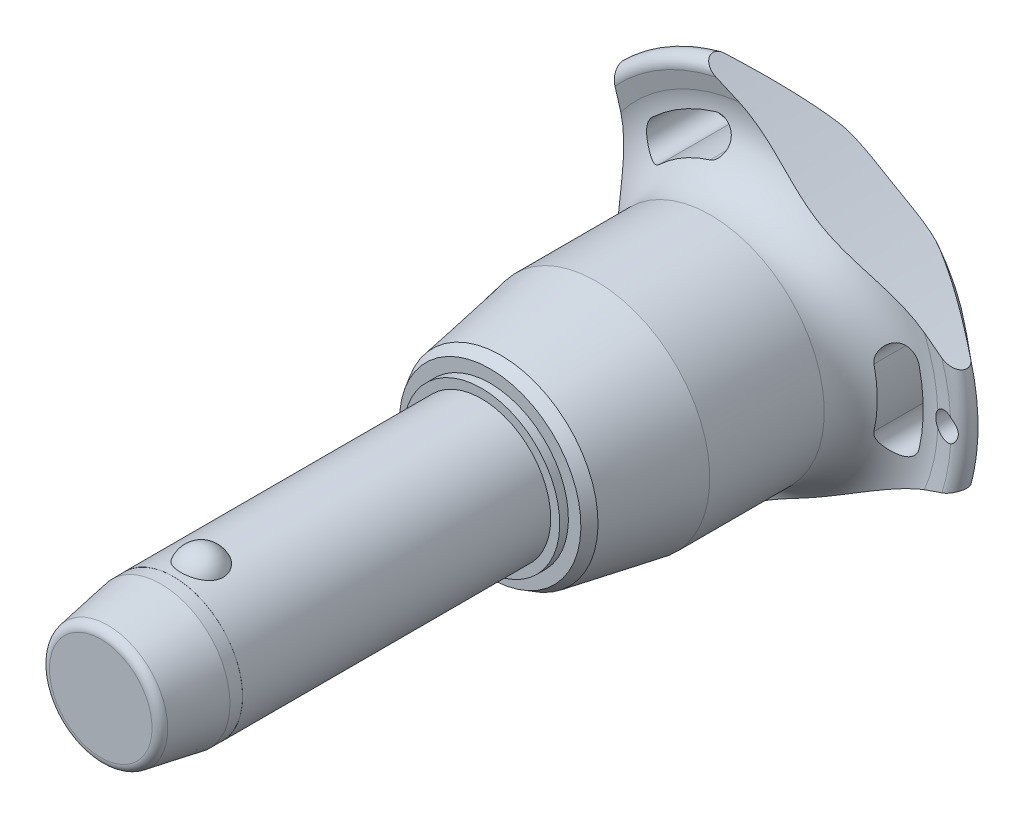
from build123d import *

# Parameters (mm, degrees)
SKETCH1_R           = 8
BOSS_EXTRUDE1_DEPTH = 30
SKETCH2_R           = 7
BOSS_EXTRUDE2_DEPTH = 39.7
BOSS_EXTRUDE3_START = 14
SKETCH1_2_R         = 8
BOSS_EXTRUDE3_DEPTH = 14
CHAMFER1_SIZE       = 7
CHAMFER1_SIZE2      = 1.234288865
FILLET1_R           = 1
SKETCH6_R           = 144.275
CUT_EXTRUDE1_DEPTH  = 78.404041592
CIRPATTERN1_COUNT   = 3
SKETCH7_R           = 1.5
CUT_EXTRUDE2_DEPTH  = 78.144330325
SKETCH8_R           = 8
SKETCH8_R_2         = 7.99
CUT_EXTRUDE3_DEPTH  = 8.4


with BuildPart() as part:
    # Sketch1 → Boss-Extrude1 (new body)
    with BuildSketch(Plane.XY):
        Circle(SKETCH1_R)
    extrude(amount=-BOSS_EXTRUDE1_DEPTH)

    # Sketch2 → Boss-Extrude2 (add)
    with BuildSketch(Plane(origin=(0, 0, -30), x_dir=(-1, 0, 0), z_dir=(0, 0, -1))):
        Circle(SKETCH2_R)
    extrude(amount=BOSS_EXTRUDE2_DEPTH)

    # Sketch3 → Revolve1 (revolve)
    with BuildSketch(Plane(origin=(0, 0, 0), x_dir=(0, 0, -1), z_dir=(1, 0, 0))):
        with BuildLine():
            Line((-2.387467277, 9.5), (-2.387467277, 4.2))
            ThreePointArc((-2.387467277, 4.2), (0.262532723, 6.85), (-2.387467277, 9.5))
        make_face()
        with BuildLine():
            Line((-2.387467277, -4.2), (-2.387467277, -9.5))
            ThreePointArc((-2.387467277, -9.5), (0.262532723, -6.85), (-2.387467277, -4.2))
        make_face()
    revolve(axis=Axis((0, -4.2, 2.387467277), (0, 1, 0)))

    # Sketch1_2 → Boss-Extrude3 (add)
    with BuildSketch(Plane.XY.offset(BOSS_EXTRUDE3_START)):
        Circle(SKETCH1_2_R)
    extrude(amount=-BOSS_EXTRUDE3_DEPTH)

    # Chamfer1
    chamfer1_edges = [part.edges().sort_by_distance(p)[0] for p in [
        (-8, 0, 14),
    ]]
    chamfer1_side = [part.faces().sort_by_distance(p)[0] for p in [
        (-8, 0, -8),
    ]]
    chamfer(chamfer1_edges, length=CHAMFER1_SIZE, length2=CHAMFER1_SIZE2, reference=chamfer1_side[0])

    # Fillet1
    fillet1_edges = [part.edges().sort_by_distance(p)[0] for p in [
        (-6.765711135, 0, 14),
        (7, 0, -69.7),
    ]]
    fillet(fillet1_edges, radius=FILLET1_R)

    # Sketch4 → Revolve2 (revolve)
    with BuildSketch(Plane(origin=(0, 0, 0), x_dir=(0, 0, -1), z_dir=(1, 0, 0))):
        Polygon((30, 0), (30, 9.044607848), (31, 9.044607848), (31, 10.490707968), (32.25235944, 11.213758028), (43.233333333, 13.15), (56.466666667, 13.15), (56.466666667, 0), align=None)
    revolve(axis=Axis((0, 0, -56.466666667), (0, 0, 1)))

    # Sketch5 → Revolve3 (revolve)
    with BuildSketch(Plane(origin=(0, 0, 0), x_dir=(0, 0, -1), z_dir=(1, 0, 0)), mode=Mode.PRIVATE) as revolve3_sk:
        with BuildLine():
            Line((62.32877039, 20.428960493), (61.910912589, 22.344207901))
            ThreePointArc((61.910912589, 22.344207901), (62.554394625, 23.677136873), (64.002586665, 23.371345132))
            Line((64.002586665, 23.371345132), (69.141488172, 17.247040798))
            ThreePointArc((69.141488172, 17.247040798), (69.7, 15.584758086), (68.978803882, 13.986322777))
            ThreePointArc((68.978803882, 13.986322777), (64.617427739, 7.589034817), (63.083333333, 0))
            Line((63.083333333, 0), (56.466666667, 0))
            Line((56.466666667, 0), (56.466666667, 13.15))
            ThreePointArc((56.466666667, 13.15), (61.139661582, 15.38660811), (62.32877039, 20.428960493))
        make_face()
    revolve(revolve3_sk.sketch.rotate(Axis((0, 0, -63.083333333), (0, 0, 1)), 90), axis=Axis((0, 0, -63.083333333), (0, 0, 1)))

    # Sketch6 → Cut-Extrude1 (cut, through all)
    with BuildSketch(Plane.XY):
        with Locations((-159.975, 0)):
            Circle(SKETCH6_R)
        with BuildLine():
            ThreePointArc((18.131206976, -4.190753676), (18.60922037, 0), (18.131206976, 4.190753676))
            ThreePointArc((18.131206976, 4.190753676), (15.94840906, 5.553949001), (14.585213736, 3.371151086))
            ThreePointArc((14.585213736, 3.371151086), (14.969740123, 0), (14.585213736, -3.371151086))
            ThreePointArc((14.585213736, -3.371151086), (15.94840906, -5.553949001), (18.131206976, -4.190753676))
        make_face()
    cut_extrude1 = extrude(amount=-CUT_EXTRUDE1_DEPTH, mode=Mode.SUBTRACT)

    # CirPattern1: Cut-Extrude1 ×3 about axis
    cirpattern1_axis = Axis((0, 0, 0), (0, 0, 1))
    for i in range(1, CIRPATTERN1_COUNT):
        add(cut_extrude1.rotate(cirpattern1_axis, i * 360 / CIRPATTERN1_COUNT), mode=Mode.SUBTRACT)

    # Sketch7 → Cut-Extrude2 (cut, through all)
    with BuildSketch(Plane.XY):
        with Locations(Location((21.60922037, 0, 0), (0, 0, 297.620773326))):
            Circle(SKETCH7_R)
    extrude(amount=-CUT_EXTRUDE2_DEPTH, mode=Mode.SUBTRACT)

    # Sketch8 → Cut-Extrude3 (cut)
    with BuildSketch(Plane.XY.offset(14)):
        Circle(SKETCH8_R)
        Circle(SKETCH8_R_2, mode=Mode.SUBTRACT)
    extrude(amount=-CUT_EXTRUDE3_DEPTH, mode=Mode.SUBTRACT)


solid = part.part
